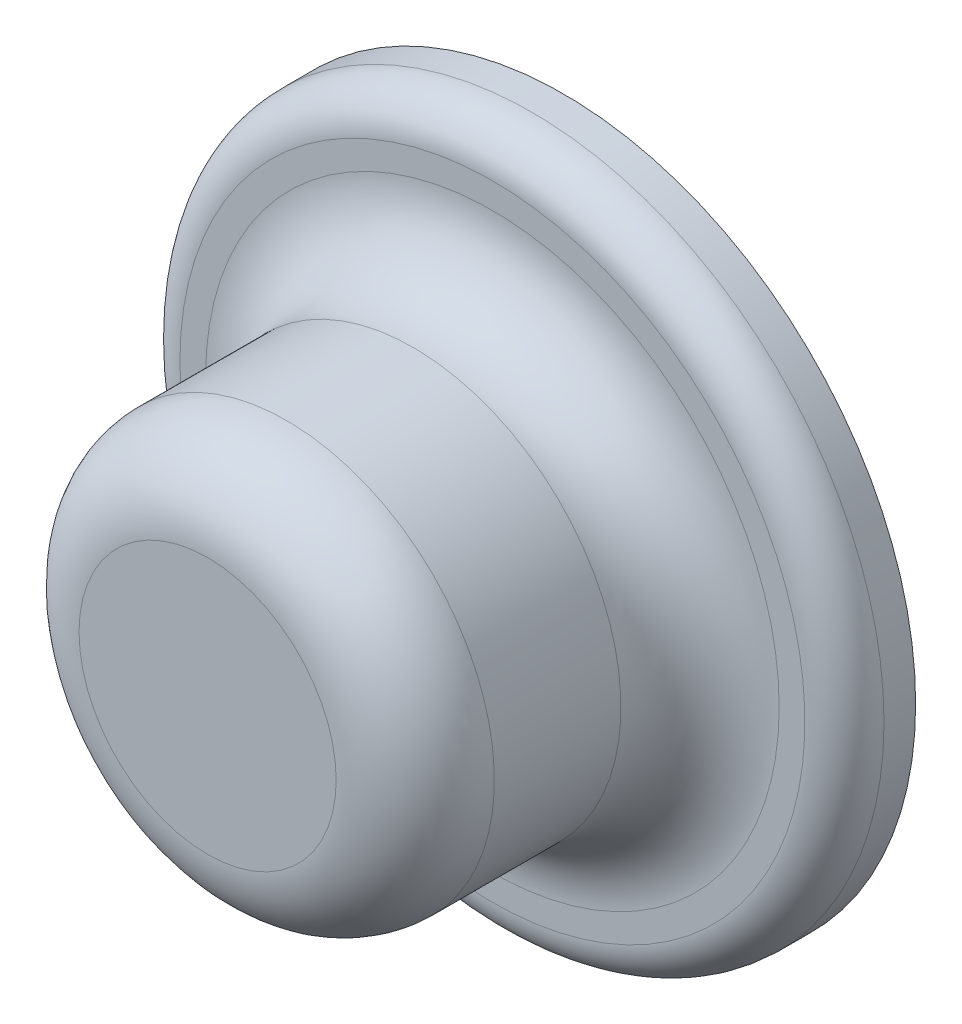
ISO-10303-21;
HEADER;
FILE_DESCRIPTION(('STEP AP214'),'2;1');
FILE_NAME('part.step','',(''),(''),'','','');
FILE_SCHEMA(('AUTOMOTIVE_DESIGN { 1 0 10303 214 1 1 1 1 }'));
ENDSEC;
DATA;
#1=APPLICATION_CONTEXT('core data for automotive mechanical design processes');
#2=APPLICATION_PROTOCOL_DEFINITION('international standard','automotive_design',2000,#1);
#3=PRODUCT_CONTEXT('',#1,'mechanical');
#4=PRODUCT('Part','Part','',(#3));
#5=PRODUCT_RELATED_PRODUCT_CATEGORY('part','',(#4));
#6=PRODUCT_DEFINITION_FORMATION('','',#4);
#7=PRODUCT_DEFINITION_CONTEXT('part definition',#1,'design');
#8=PRODUCT_DEFINITION('design','',#6,#7);
#9=PRODUCT_DEFINITION_SHAPE('','',#8);
#10=(LENGTH_UNIT() NAMED_UNIT(*) SI_UNIT(.MILLI.,.METRE.));
#11=(NAMED_UNIT(*) PLANE_ANGLE_UNIT() SI_UNIT($,.RADIAN.));
#12=(NAMED_UNIT(*) SI_UNIT($,.STERADIAN.) SOLID_ANGLE_UNIT());
#13=UNCERTAINTY_MEASURE_WITH_UNIT(LENGTH_MEASURE(1.E-05),#10,'distance_accuracy_value','');
#14=(GEOMETRIC_REPRESENTATION_CONTEXT(3) GLOBAL_UNCERTAINTY_ASSIGNED_CONTEXT((#13)) GLOBAL_UNIT_ASSIGNED_CONTEXT((#10,
#11,#12)) REPRESENTATION_CONTEXT('',''));
#15=CARTESIAN_POINT('',(0.,0.,0.));
#16=DIRECTION('',(0.,0.,1.));
#17=DIRECTION('',(1.,0.,0.));
#18=AXIS2_PLACEMENT_3D('',#15,#16,#17);
#19=CARTESIAN_POINT('',(0.,0.,48.5389179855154));
#20=DIRECTION('',(0.,0.,-1.));
#21=DIRECTION('',(-1.,0.,0.));
#22=AXIS2_PLACEMENT_3D('',#19,#20,#21);
#23=CYLINDRICAL_SURFACE('',#22,37.5);
#24=CARTESIAN_POINT('',(0.,0.,103.));
#25=DIRECTION('',(0.,0.,-1.));
#26=DIRECTION('',(-1.,0.,0.));
#27=AXIS2_PLACEMENT_3D('',#24,#25,#26);
#28=CIRCLE('',#27,37.5);
#29=CARTESIAN_POINT('',(-37.5,0.,103.));
#30=VERTEX_POINT('',#29);
#31=EDGE_CURVE('E74',#30,#30,#28,.T.);
#32=ORIENTED_EDGE('',*,*,#31,.T.);
#33=EDGE_LOOP('',(#32));
#34=FACE_BOUND('',#33,.T.);
#35=CARTESIAN_POINT('',(0.,0.,130.));
#36=DIRECTION('',(0.,0.,-1.));
#37=DIRECTION('',(-1.,0.,0.));
#38=AXIS2_PLACEMENT_3D('',#35,#36,#37);
#39=CIRCLE('',#38,37.5);
#40=CARTESIAN_POINT('',(-37.5,0.,130.));
#41=VERTEX_POINT('',#40);
#42=EDGE_CURVE('E10',#41,#41,#39,.T.);
#43=ORIENTED_EDGE('',*,*,#42,.F.);
#44=EDGE_LOOP('',(#43));
#45=FACE_BOUND('',#44,.T.);
#46=ADVANCED_FACE('F28',(#34,#45),#23,.F.);
#47=CARTESIAN_POINT('',(0.,0.,130.));
#48=DIRECTION('',(0.,0.,-1.));
#49=DIRECTION('',(-1.,0.,0.));
#50=AXIS2_PLACEMENT_3D('',#47,#48,#49);
#51=TOROIDAL_SURFACE('',#50,27.5,10.);
#52=ORIENTED_EDGE('',*,*,#42,.T.);
#53=EDGE_LOOP('',(#52));
#54=FACE_BOUND('',#53,.T.);
#55=CARTESIAN_POINT('',(0.,0.,140.));
#56=DIRECTION('',(0.,0.,-1.));
#57=DIRECTION('',(-1.,0.,0.));
#58=AXIS2_PLACEMENT_3D('',#55,#56,#57);
#59=CIRCLE('',#58,27.5);
#60=CARTESIAN_POINT('',(-27.5,0.,140.));
#61=VERTEX_POINT('',#60);
#62=EDGE_CURVE('E34',#61,#61,#59,.T.);
#63=ORIENTED_EDGE('',*,*,#62,.F.);
#64=EDGE_LOOP('',(#63));
#65=FACE_BOUND('',#64,.T.);
#66=ADVANCED_FACE('F92',(#54,#65),#51,.F.);
#67=CARTESIAN_POINT('',(-27.5,0.,140.));
#68=DIRECTION('',(0.,0.,-1.));
#69=DIRECTION('',(-1.,0.,0.));
#70=AXIS2_PLACEMENT_3D('',#67,#68,#69);
#71=PLANE('',#70);
#72=ORIENTED_EDGE('',*,*,#62,.T.);
#73=EDGE_LOOP('',(#72));
#74=FACE_BOUND('',#73,.T.);
#75=ADVANCED_FACE('F96',(#74),#71,.T.);
#76=CARTESIAN_POINT('',(0.,0.,160.));
#77=DIRECTION('',(0.,0.,1.));
#78=DIRECTION('',(1.,0.,0.));
#79=AXIS2_PLACEMENT_3D('',#76,#77,#78);
#80=PLANE('',#79);
#81=CARTESIAN_POINT('',(0.,0.,160.));
#82=DIRECTION('',(0.,0.,-1.));
#83=DIRECTION('',(-1.,0.,0.));
#84=AXIS2_PLACEMENT_3D('',#81,#82,#83);
#85=CIRCLE('',#84,32.5);
#86=CARTESIAN_POINT('',(-32.5,0.,160.));
#87=VERTEX_POINT('',#86);
#88=EDGE_CURVE('E38',#87,#87,#85,.T.);
#89=ORIENTED_EDGE('',*,*,#88,.F.);
#90=EDGE_LOOP('',(#89));
#91=FACE_BOUND('',#90,.T.);
#92=ADVANCED_FACE('F100',(#91),#80,.T.);
#93=CARTESIAN_POINT('',(0.,0.,140.));
#94=DIRECTION('',(0.,0.,-1.));
#95=DIRECTION('',(-1.,0.,0.));
#96=AXIS2_PLACEMENT_3D('',#93,#94,#95);
#97=TOROIDAL_SURFACE('',#96,32.5,20.);
#98=ORIENTED_EDGE('',*,*,#88,.T.);
#99=EDGE_LOOP('',(#98));
#100=FACE_BOUND('',#99,.T.);
#101=CARTESIAN_POINT('',(0.,0.,140.));
#102=DIRECTION('',(0.,0.,-1.));
#103=DIRECTION('',(-1.,0.,0.));
#104=AXIS2_PLACEMENT_3D('',#101,#102,#103);
#105=CIRCLE('',#104,52.5);
#106=CARTESIAN_POINT('',(-52.5,0.,140.));
#107=VERTEX_POINT('',#106);
#108=EDGE_CURVE('E42',#107,#107,#105,.T.);
#109=ORIENTED_EDGE('',*,*,#108,.F.);
#110=EDGE_LOOP('',(#109));
#111=FACE_BOUND('',#110,.T.);
#112=ADVANCED_FACE('F106',(#100,#111),#97,.T.);
#113=CARTESIAN_POINT('',(0.,0.,48.5389179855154));
#114=DIRECTION('',(0.,0.,-1.));
#115=DIRECTION('',(-1.,0.,0.));
#116=AXIS2_PLACEMENT_3D('',#113,#114,#115);
#117=CYLINDRICAL_SURFACE('',#116,52.5);
#118=ORIENTED_EDGE('',*,*,#108,.T.);
#119=EDGE_LOOP('',(#118));
#120=FACE_BOUND('',#119,.T.);
#121=CARTESIAN_POINT('',(0.,0.,107.998633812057));
#122=DIRECTION('',(0.,0.,-1.));
#123=DIRECTION('',(-1.,0.,0.));
#124=AXIS2_PLACEMENT_3D('',#121,#122,#123);
#125=CIRCLE('',#124,52.5);
#126=CARTESIAN_POINT('',(-52.5,0.,107.998633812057));
#127=VERTEX_POINT('',#126);
#128=EDGE_CURVE('E47',#127,#127,#125,.T.);
#129=ORIENTED_EDGE('',*,*,#128,.F.);
#130=EDGE_LOOP('',(#129));
#131=FACE_BOUND('',#130,.T.);
#132=ADVANCED_FACE('F110',(#120,#131),#117,.T.);
#133=CARTESIAN_POINT('',(0.,0.,107.998633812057));
#134=DIRECTION('',(0.,0.,-1.));
#135=DIRECTION('',(-1.,0.,0.));
#136=AXIS2_PLACEMENT_3D('',#133,#134,#135);
#137=TOROIDAL_SURFACE('',#136,72.5,20.);
#138=ORIENTED_EDGE('',*,*,#128,.T.);
#139=EDGE_LOOP('',(#138));
#140=FACE_BOUND('',#139,.T.);
#141=CARTESIAN_POINT('',(0.,0.,87.9986338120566));
#142=DIRECTION('',(0.,0.,-1.));
#143=DIRECTION('',(-1.,0.,0.));
#144=AXIS2_PLACEMENT_3D('',#141,#142,#143);
#145=CIRCLE('',#144,72.5);
#146=CARTESIAN_POINT('',(-72.5,0.,87.9986338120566));
#147=VERTEX_POINT('',#146);
#148=EDGE_CURVE('E50',#147,#147,#145,.T.);
#149=ORIENTED_EDGE('',*,*,#148,.F.);
#150=EDGE_LOOP('',(#149));
#151=FACE_BOUND('',#150,.T.);
#152=ADVANCED_FACE('F114',(#140,#151),#137,.F.);
#153=CARTESIAN_POINT('',(-72.5,0.,87.9986338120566));
#154=DIRECTION('',(0.,0.,1.));
#155=DIRECTION('',(1.,0.,0.));
#156=AXIS2_PLACEMENT_3D('',#153,#154,#155);
#157=PLANE('',#156);
#158=ORIENTED_EDGE('',*,*,#148,.T.);
#159=EDGE_LOOP('',(#158));
#160=FACE_BOUND('',#159,.T.);
#161=CARTESIAN_POINT('',(0.,0.,87.9986338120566));
#162=DIRECTION('',(0.,0.,-1.));
#163=DIRECTION('',(-1.,0.,0.));
#164=AXIS2_PLACEMENT_3D('',#161,#162,#163);
#165=CIRCLE('',#164,79.);
#166=CARTESIAN_POINT('',(-79.,0.,87.9986338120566));
#167=VERTEX_POINT('',#166);
#168=EDGE_CURVE('E53',#167,#167,#165,.T.);
#169=ORIENTED_EDGE('',*,*,#168,.F.);
#170=EDGE_LOOP('',(#169));
#171=FACE_BOUND('',#170,.T.);
#172=ADVANCED_FACE('F118',(#160,#171),#157,.T.);
#173=CARTESIAN_POINT('',(0.,0.,77.9986338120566));
#174=DIRECTION('',(0.,0.,-1.));
#175=DIRECTION('',(-1.,0.,0.));
#176=AXIS2_PLACEMENT_3D('',#173,#174,#175);
#177=TOROIDAL_SURFACE('',#176,79.,10.);
#178=ORIENTED_EDGE('',*,*,#168,.T.);
#179=EDGE_LOOP('',(#178));
#180=FACE_BOUND('',#179,.T.);
#181=CARTESIAN_POINT('',(0.,0.,77.9986338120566));
#182=DIRECTION('',(0.,0.,-1.));
#183=DIRECTION('',(-1.,0.,0.));
#184=AXIS2_PLACEMENT_3D('',#181,#182,#183);
#185=CIRCLE('',#184,89.);
#186=CARTESIAN_POINT('',(-89.,0.,77.9986338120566));
#187=VERTEX_POINT('',#186);
#188=EDGE_CURVE('E56',#187,#187,#185,.T.);
#189=ORIENTED_EDGE('',*,*,#188,.F.);
#190=EDGE_LOOP('',(#189));
#191=FACE_BOUND('',#190,.T.);
#192=ADVANCED_FACE('F122',(#180,#191),#177,.T.);
#193=CARTESIAN_POINT('',(0.,0.,48.5389179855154));
#194=DIRECTION('',(0.,0.,-1.));
#195=DIRECTION('',(-1.,0.,0.));
#196=AXIS2_PLACEMENT_3D('',#193,#194,#195);
#197=CYLINDRICAL_SURFACE('',#196,89.);
#198=ORIENTED_EDGE('',*,*,#188,.T.);
#199=EDGE_LOOP('',(#198));
#200=FACE_BOUND('',#199,.T.);
#201=CARTESIAN_POINT('',(0.,0.,70.));
#202=DIRECTION('',(0.,0.,-1.));
#203=DIRECTION('',(-1.,0.,0.));
#204=AXIS2_PLACEMENT_3D('',#201,#202,#203);
#205=CIRCLE('',#204,89.);
#206=CARTESIAN_POINT('',(-89.,0.,70.));
#207=VERTEX_POINT('',#206);
#208=EDGE_CURVE('E59',#207,#207,#205,.T.);
#209=ORIENTED_EDGE('',*,*,#208,.F.);
#210=EDGE_LOOP('',(#209));
#211=FACE_BOUND('',#210,.T.);
#212=ADVANCED_FACE('F126',(#200,#211),#197,.T.);
#213=CARTESIAN_POINT('',(-89.,0.,70.));
#214=DIRECTION('',(0.,0.,-1.));
#215=DIRECTION('',(-1.,0.,0.));
#216=AXIS2_PLACEMENT_3D('',#213,#214,#215);
#217=PLANE('',#216);
#218=ORIENTED_EDGE('',*,*,#208,.T.);
#219=EDGE_LOOP('',(#218));
#220=FACE_BOUND('',#219,.T.);
#221=CARTESIAN_POINT('',(0.,0.,70.));
#222=DIRECTION('',(0.,0.,-1.));
#223=DIRECTION('',(-1.,0.,0.));
#224=AXIS2_PLACEMENT_3D('',#221,#222,#223);
#225=CIRCLE('',#224,60.);
#226=CARTESIAN_POINT('',(-60.,0.,70.));
#227=VERTEX_POINT('',#226);
#228=EDGE_CURVE('E62',#227,#227,#225,.T.);
#229=ORIENTED_EDGE('',*,*,#228,.F.);
#230=EDGE_LOOP('',(#229));
#231=FACE_BOUND('',#230,.T.);
#232=ADVANCED_FACE('F130',(#220,#231),#217,.T.);
#233=CARTESIAN_POINT('',(0.,0.,48.5389179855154));
#234=DIRECTION('',(0.,0.,-1.));
#235=DIRECTION('',(-1.,0.,0.));
#236=AXIS2_PLACEMENT_3D('',#233,#234,#235);
#237=CYLINDRICAL_SURFACE('',#236,60.);
#238=ORIENTED_EDGE('',*,*,#228,.T.);
#239=EDGE_LOOP('',(#238));
#240=FACE_BOUND('',#239,.T.);
#241=CARTESIAN_POINT('',(0.,0.,82.));
#242=DIRECTION('',(0.,0.,-1.));
#243=DIRECTION('',(-1.,0.,0.));
#244=AXIS2_PLACEMENT_3D('',#241,#242,#243);
#245=CIRCLE('',#244,60.);
#246=CARTESIAN_POINT('',(-60.,0.,82.));
#247=VERTEX_POINT('',#246);
#248=EDGE_CURVE('E65',#247,#247,#245,.T.);
#249=ORIENTED_EDGE('',*,*,#248,.F.);
#250=EDGE_LOOP('',(#249));
#251=FACE_BOUND('',#250,.T.);
#252=ADVANCED_FACE('F134',(#240,#251),#237,.F.);
#253=CARTESIAN_POINT('',(-43.,0.,82.));
#254=DIRECTION('',(0.,0.,-1.));
#255=DIRECTION('',(-1.,0.,0.));
#256=AXIS2_PLACEMENT_3D('',#253,#254,#255);
#257=PLANE('',#256);
#258=ORIENTED_EDGE('',*,*,#248,.T.);
#259=EDGE_LOOP('',(#258));
#260=FACE_BOUND('',#259,.T.);
#261=CARTESIAN_POINT('',(0.,0.,82.));
#262=DIRECTION('',(0.,0.,-1.));
#263=DIRECTION('',(-1.,0.,0.));
#264=AXIS2_PLACEMENT_3D('',#261,#262,#263);
#265=CIRCLE('',#264,43.);
#266=CARTESIAN_POINT('',(-43.,0.,82.));
#267=VERTEX_POINT('',#266);
#268=EDGE_CURVE('E68',#267,#267,#265,.T.);
#269=ORIENTED_EDGE('',*,*,#268,.F.);
#270=EDGE_LOOP('',(#269));
#271=FACE_BOUND('',#270,.T.);
#272=ADVANCED_FACE('F88',(#260,#271),#257,.T.);
#273=CARTESIAN_POINT('',(0.,0.,48.5389179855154));
#274=DIRECTION('',(0.,0.,-1.));
#275=DIRECTION('',(-1.,0.,0.));
#276=AXIS2_PLACEMENT_3D('',#273,#274,#275);
#277=CYLINDRICAL_SURFACE('',#276,43.);
#278=ORIENTED_EDGE('',*,*,#268,.T.);
#279=EDGE_LOOP('',(#278));
#280=FACE_BOUND('',#279,.T.);
#281=CARTESIAN_POINT('',(0.,0.,103.));
#282=DIRECTION('',(0.,0.,-1.));
#283=DIRECTION('',(-1.,0.,0.));
#284=AXIS2_PLACEMENT_3D('',#281,#282,#283);
#285=CIRCLE('',#284,43.);
#286=CARTESIAN_POINT('',(-43.,0.,103.));
#287=VERTEX_POINT('',#286);
#288=EDGE_CURVE('E71',#287,#287,#285,.T.);
#289=ORIENTED_EDGE('',*,*,#288,.F.);
#290=EDGE_LOOP('',(#289));
#291=FACE_BOUND('',#290,.T.);
#292=ADVANCED_FACE('F82',(#280,#291),#277,.F.);
#293=CARTESIAN_POINT('',(-37.5,0.,103.));
#294=DIRECTION('',(0.,0.,-1.));
#295=DIRECTION('',(-1.,0.,0.));
#296=AXIS2_PLACEMENT_3D('',#293,#294,#295);
#297=PLANE('',#296);
#298=ORIENTED_EDGE('',*,*,#288,.T.);
#299=EDGE_LOOP('',(#298));
#300=FACE_BOUND('',#299,.T.);
#301=ORIENTED_EDGE('',*,*,#31,.F.);
#302=EDGE_LOOP('',(#301));
#303=FACE_BOUND('',#302,.T.);
#304=ADVANCED_FACE('F80',(#300,#303),#297,.T.);
#305=CLOSED_SHELL('',(#46,#66,#75,#92,#112,#132,#152,#172,#192,#212,#232,#252,#272,#292,#304));
#306=MANIFOLD_SOLID_BREP('B2',#305);
#307=ADVANCED_BREP_SHAPE_REPRESENTATION('',(#18,#306),#14);
#308=SHAPE_DEFINITION_REPRESENTATION(#9,#307);
ENDSEC;
END-ISO-10303-21;
